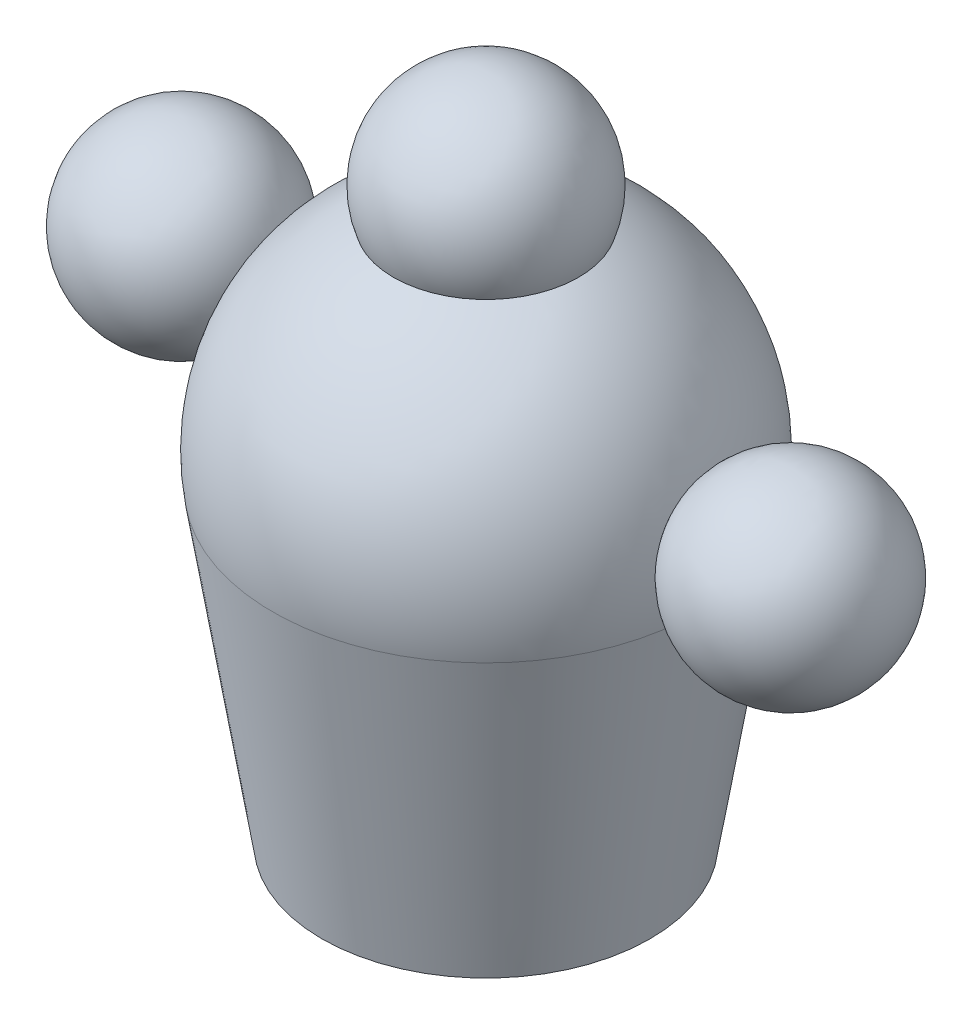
ISO-10303-21;
HEADER;
FILE_DESCRIPTION(('STEP AP214'),'2;1');
FILE_NAME('part.step','',(''),(''),'','','');
FILE_SCHEMA(('AUTOMOTIVE_DESIGN { 1 0 10303 214 1 1 1 1 }'));
ENDSEC;
DATA;
#1=APPLICATION_CONTEXT('core data for automotive mechanical design processes');
#2=APPLICATION_PROTOCOL_DEFINITION('international standard','automotive_design',2000,#1);
#3=PRODUCT_CONTEXT('',#1,'mechanical');
#4=PRODUCT('Part','Part','',(#3));
#5=PRODUCT_RELATED_PRODUCT_CATEGORY('part','',(#4));
#6=PRODUCT_DEFINITION_FORMATION('','',#4);
#7=PRODUCT_DEFINITION_CONTEXT('part definition',#1,'design');
#8=PRODUCT_DEFINITION('design','',#6,#7);
#9=PRODUCT_DEFINITION_SHAPE('','',#8);
#10=(LENGTH_UNIT() NAMED_UNIT(*) SI_UNIT(.MILLI.,.METRE.));
#11=(NAMED_UNIT(*) PLANE_ANGLE_UNIT() SI_UNIT($,.RADIAN.));
#12=(NAMED_UNIT(*) SI_UNIT($,.STERADIAN.) SOLID_ANGLE_UNIT());
#13=UNCERTAINTY_MEASURE_WITH_UNIT(LENGTH_MEASURE(1.E-05),#10,'distance_accuracy_value','');
#14=(GEOMETRIC_REPRESENTATION_CONTEXT(3) GLOBAL_UNCERTAINTY_ASSIGNED_CONTEXT((#13)) GLOBAL_UNIT_ASSIGNED_CONTEXT((#10,
#11,#12)) REPRESENTATION_CONTEXT('',''));
#15=CARTESIAN_POINT('',(0.,0.,0.));
#16=DIRECTION('',(0.,0.,1.));
#17=DIRECTION('',(1.,0.,0.));
#18=AXIS2_PLACEMENT_3D('',#15,#16,#17);
#19=CARTESIAN_POINT('',(0.,179.699675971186,0.));
#20=DIRECTION('',(0.,-1.,0.));
#21=DIRECTION('',(1.,0.,0.));
#22=AXIS2_PLACEMENT_3D('',#19,#20,#21);
#23=SPHERICAL_SURFACE('',#22,113.550324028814);
#24=CARTESIAN_POINT('',(111.80528808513,194.758677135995,0.));
#25=DIRECTION('',(0.991050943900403,0.133484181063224,0.));
#26=DIRECTION('',(-0.133484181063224,0.991050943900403,0.));
#27=AXIS2_PLACEMENT_3D('',#24,#25,#26);
#28=CIRCLE('',#27,12.9027178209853);
#29=CARTESIAN_POINT('',(110.082979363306,207.545927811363,0.));
#30=VERTEX_POINT('',#29);
#31=EDGE_CURVE('E87',#30,#30,#28,.F.);
#32=ORIENTED_EDGE('',*,*,#31,.T.);
#33=EDGE_LOOP('',(#32));
#34=FACE_BOUND('',#33,.T.);
#35=CARTESIAN_POINT('',(0.,179.699675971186,-90.));
#36=DIRECTION('',(0.,0.,1.));
#37=DIRECTION('',(1.,0.,0.));
#38=AXIS2_PLACEMENT_3D('',#35,#36,#37);
#39=CIRCLE('',#38,69.2363783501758);
#40=CARTESIAN_POINT('',(-66.8731308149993,161.764780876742,-90.));
#41=VERTEX_POINT('',#40);
#42=CARTESIAN_POINT('',(66.8731308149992,161.764780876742,-90.));
#43=VERTEX_POINT('',#42);
#44=EDGE_CURVE('E58',#41,#43,#39,.F.);
#45=ORIENTED_EDGE('',*,*,#44,.F.);
#46=CARTESIAN_POINT('',(0.,161.764780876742,0.));
#47=DIRECTION('',(0.,-1.,0.));
#48=DIRECTION('',(0.,0.,-1.));
#49=AXIS2_PLACEMENT_3D('',#46,#47,#48);
#50=CIRCLE('',#49,112.125);
#51=EDGE_CURVE('E44',#43,#41,#50,.T.);
#52=ORIENTED_EDGE('',*,*,#51,.F.);
#53=EDGE_LOOP('',(#45,#52));
#54=FACE_BOUND('',#53,.T.);
#55=CARTESIAN_POINT('',(-111.80528808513,194.758677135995,0.));
#56=DIRECTION('',(-0.991050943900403,0.133484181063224,0.));
#57=DIRECTION('',(-0.133484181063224,-0.991050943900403,0.));
#58=AXIS2_PLACEMENT_3D('',#55,#56,#57);
#59=CIRCLE('',#58,12.9027178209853);
#60=CARTESIAN_POINT('',(-113.527596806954,181.971426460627,0.));
#61=VERTEX_POINT('',#60);
#62=EDGE_CURVE('E62',#61,#61,#59,.F.);
#63=ORIENTED_EDGE('',*,*,#62,.T.);
#64=EDGE_LOOP('',(#63));
#65=FACE_BOUND('',#64,.T.);
#66=CARTESIAN_POINT('',(0.,282.308632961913,0.));
#67=DIRECTION('',(0.,1.,0.));
#68=DIRECTION('',(0.,0.,1.));
#69=AXIS2_PLACEMENT_3D('',#66,#67,#68);
#70=CIRCLE('',#69,48.6320679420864);
#71=CARTESIAN_POINT('',(0.,282.308632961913,48.6320679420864));
#72=VERTEX_POINT('',#71);
#73=EDGE_CURVE('E39',#72,#72,#70,.F.);
#74=ORIENTED_EDGE('',*,*,#73,.T.);
#75=EDGE_LOOP('',(#74));
#76=FACE_BOUND('',#75,.T.);
#77=ADVANCED_FACE('F36',(#34,#54,#65,#76),#23,.T.);
#78=CARTESIAN_POINT('',(0.,0.,0.));
#79=DIRECTION('',(0.,1.,0.));
#80=DIRECTION('',(0.,0.,1.));
#81=AXIS2_PLACEMENT_3D('',#78,#79,#80);
#82=CONICAL_SURFACE('',#81,86.25,0.15861086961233);
#83=CARTESIAN_POINT('',(-147.890131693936,543.109312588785,-90.));
#84=CARTESIAN_POINT('',(-146.745586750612,536.996806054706,-90.));
#85=CARTESIAN_POINT('',(-145.59758522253,530.88494749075,-90.));
#86=CARTESIAN_POINT('',(-143.294137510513,518.66263228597,-90.));
#87=CARTESIAN_POINT('',(-142.138691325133,512.552175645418,-90.));
#88=CARTESIAN_POINT('',(-138.660377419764,494.223008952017,-90.));
#89=CARTESIAN_POINT('',(-136.325545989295,482.006564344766,-90.));
#90=CARTESIAN_POINT('',(-132.795261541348,463.686173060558,-90.));
#91=CARTESIAN_POINT('',(-131.613720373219,457.579543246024,-90.));
#92=CARTESIAN_POINT('',(-129.240576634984,445.36824073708,-90.));
#93=CARTESIAN_POINT('',(-128.048974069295,439.263568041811,-90.));
#94=CARTESIAN_POINT('',(-125.654855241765,427.056378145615,-90.));
#95=CARTESIAN_POINT('',(-124.45233900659,420.953860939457,-90.));
#96=CARTESIAN_POINT('',(-122.035417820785,408.751169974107,-90.));
#97=CARTESIAN_POINT('',(-120.821012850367,402.650996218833,-90.));
#98=CARTESIAN_POINT('',(-118.374860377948,390.431474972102,-90.));
#99=CARTESIAN_POINT('',(-117.14306644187,384.312136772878,-90.));
#100=CARTESIAN_POINT('',(-114.665137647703,372.076364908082,-90.));
#101=CARTESIAN_POINT('',(-113.419002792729,365.959931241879,-90.));
#102=CARTESIAN_POINT('',(-110.910944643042,353.730310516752,-90.));
#103=CARTESIAN_POINT('',(-109.649021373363,347.617123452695,-90.));
#104=CARTESIAN_POINT('',(-107.107713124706,335.394382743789,-90.));
#105=CARTESIAN_POINT('',(-105.828328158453,329.284829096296,-90.));
#106=CARTESIAN_POINT('',(-103.250253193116,317.070295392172,-90.));
#107=CARTESIAN_POINT('',(-101.951564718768,310.965315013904,-90.));
#108=CARTESIAN_POINT('',(-99.332507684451,298.760002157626,-90.));
#109=CARTESIAN_POINT('',(-98.0121391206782,292.659669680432,-90.));
#110=CARTESIAN_POINT('',(-95.3470400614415,280.464376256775,-90.));
#111=CARTESIAN_POINT('',(-94.0023097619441,274.369415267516,-90.));
#112=CARTESIAN_POINT('',(-91.2852673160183,262.185649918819,-90.));
#113=CARTESIAN_POINT('',(-89.9129552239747,256.096845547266,-90.));
#114=CARTESIAN_POINT('',(-87.3361414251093,244.800110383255,-90.));
#115=CARTESIAN_POINT('',(-86.1358352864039,239.591222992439,-90.));
#116=CARTESIAN_POINT('',(-83.7091763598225,229.179511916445,-90.));
#117=CARTESIAN_POINT('',(-82.4828235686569,223.976688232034,-90.));
#118=CARTESIAN_POINT('',(-80.0004438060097,213.577743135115,-90.));
#119=CARTESIAN_POINT('',(-78.7444148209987,208.38162220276,-90.));
#120=CARTESIAN_POINT('',(-76.1984435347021,197.997690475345,-90.));
#121=CARTESIAN_POINT('',(-74.9085012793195,192.809879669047,-90.));
#122=CARTESIAN_POINT('',(-72.290555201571,182.448939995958,-90.));
#123=CARTESIAN_POINT('',(-70.9625875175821,177.275802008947,-90.));
#124=CARTESIAN_POINT('',(-68.2607526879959,166.941445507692,-90.));
#125=CARTESIAN_POINT('',(-66.8868852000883,161.780227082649,-90.));
#126=CARTESIAN_POINT('',(-64.7852294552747,154.049867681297,-90.));
#127=CARTESIAN_POINT('',(-64.077914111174,151.475153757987,-90.));
#128=CARTESIAN_POINT('',(-62.6482792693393,146.329897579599,-90.));
#129=CARTESIAN_POINT('',(-61.9259598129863,143.759355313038,-90.));
#130=CARTESIAN_POINT('',(-60.4648007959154,138.62300860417,-90.));
#131=CARTESIAN_POINT('',(-59.7259614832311,136.057204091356,-90.));
#132=CARTESIAN_POINT('',(-58.2299639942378,130.930947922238,-90.));
#133=CARTESIAN_POINT('',(-57.4728058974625,128.370496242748,-90.));
#134=CARTESIAN_POINT('',(-55.9367339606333,123.25128341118,-90.));
#135=CARTESIAN_POINT('',(-55.1577846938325,120.692532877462,-90.));
#136=CARTESIAN_POINT('',(-53.5768739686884,115.582141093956,-90.));
#137=CARTESIAN_POINT('',(-52.7749125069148,113.030499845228,-90.));
#138=CARTESIAN_POINT('',(-51.1447881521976,107.935020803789,-90.));
#139=CARTESIAN_POINT('',(-50.3166200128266,105.391184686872,-90.));
#140=CARTESIAN_POINT('',(-48.6305495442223,100.313380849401,-90.));
#141=CARTESIAN_POINT('',(-47.7726473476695,97.7794130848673,-90.));
#142=CARTESIAN_POINT('',(-46.0209407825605,92.7187030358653,-90.));
#143=CARTESIAN_POINT('',(-45.1270736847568,90.1919824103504,-90.));
#144=CARTESIAN_POINT('',(-43.2990962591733,85.1530390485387,-90.));
#145=CARTESIAN_POINT('',(-42.364984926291,82.6408166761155,-90.));
#146=CARTESIAN_POINT('',(-40.4494944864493,77.6355238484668,-90.));
#147=CARTESIAN_POINT('',(-39.4681347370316,75.1424460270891,-90.));
#148=CARTESIAN_POINT('',(-37.9529905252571,71.4204639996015,-90.));
#149=CARTESIAN_POINT('',(-37.4407691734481,70.1827673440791,-90.));
#150=CARTESIAN_POINT('',(-36.4003619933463,67.7141096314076,-90.));
#151=CARTESIAN_POINT('',(-35.8721763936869,66.4831484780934,-90.));
#152=CARTESIAN_POINT('',(-34.7947720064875,64.0215568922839,-90.));
#153=CARTESIAN_POINT('',(-34.245445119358,62.7909737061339,-90.));
#154=CARTESIAN_POINT('',(-33.1266062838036,60.3390375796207,-90.));
#155=CARTESIAN_POINT('',(-32.557094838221,59.1176844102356,-90.));
#156=CARTESIAN_POINT('',(-31.3948622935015,56.6851022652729,-90.));
#157=CARTESIAN_POINT('',(-30.8021267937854,55.4738801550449,-90.));
#158=CARTESIAN_POINT('',(-29.5905702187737,53.0645475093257,-90.));
#159=CARTESIAN_POINT('',(-28.9717496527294,51.8664367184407,-90.));
#160=CARTESIAN_POINT('',(-27.7059408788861,49.4897504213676,-90.));
#161=CARTESIAN_POINT('',(-27.059042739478,48.3111270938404,-90.));
#162=CARTESIAN_POINT('',(-25.730370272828,45.9734607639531,-90.));
#163=CARTESIAN_POINT('',(-25.0485924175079,44.8144197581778,-90.));
#164=CARTESIAN_POINT('',(-23.6447517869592,42.5226117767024,-90.));
#165=CARTESIAN_POINT('',(-22.9227333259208,41.3898177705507,-90.));
#166=CARTESIAN_POINT('',(-21.4299549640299,39.1569812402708,-90.));
#167=CARTESIAN_POINT('',(-20.6592092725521,38.056929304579,-90.));
#168=CARTESIAN_POINT('',(-19.2982722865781,36.2237065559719,-90.));
#169=CARTESIAN_POINT('',(-18.7231661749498,35.4793559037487,-90.));
#170=CARTESIAN_POINT('',(-17.5392282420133,34.0175606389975,-90.));
#171=CARTESIAN_POINT('',(-16.9303900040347,33.3001211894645,-90.));
#172=CARTESIAN_POINT('',(-15.6741030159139,31.9002613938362,-90.));
#173=CARTESIAN_POINT('',(-15.0266723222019,31.2178249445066,-90.));
#174=CARTESIAN_POINT('',(-13.6870256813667,29.8984734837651,-90.));
#175=CARTESIAN_POINT('',(-12.9948298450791,29.2615382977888,-90.));
#176=CARTESIAN_POINT('',(-11.808869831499,28.2594963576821,-90.));
#177=CARTESIAN_POINT('',(-11.3299177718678,27.8769521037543,-90.));
#178=CARTESIAN_POINT('',(-10.3486337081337,27.1433510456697,-90.));
#179=CARTESIAN_POINT('',(-9.84629834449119,26.7922987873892,-90.));
#180=CARTESIAN_POINT('',(-8.30324455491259,25.7976173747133,-90.));
#181=CARTESIAN_POINT('',(-7.22367285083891,25.2099962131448,-90.));
#182=CARTESIAN_POINT('',(-5.69690427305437,24.5647020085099,-90.));
#183=CARTESIAN_POINT('',(-5.28997172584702,24.4093831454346,-90.));
#184=CARTESIAN_POINT('',(-4.46545244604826,24.1304450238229,-90.));
#185=CARTESIAN_POINT('',(-4.04787131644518,24.0068094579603,-90.));
#186=CARTESIAN_POINT('',(-3.20430183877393,23.7945129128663,-90.));
#187=CARTESIAN_POINT('',(-2.7783220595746,23.705818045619,-90.));
#188=CARTESIAN_POINT('',(-1.92020634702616,23.5658348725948,-90.));
#189=CARTESIAN_POINT('',(-1.48807042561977,23.5145464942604,-90.));
#190=CARTESIAN_POINT('',(-0.618819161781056,23.4508807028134,-90.));
#191=CARTESIAN_POINT('',(-0.18168985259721,23.4386922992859,-90.));
#192=CARTESIAN_POINT('',(0.691846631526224,23.4541696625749,-90.));
#193=CARTESIAN_POINT('',(1.1282538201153,23.4818346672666,-90.));
#194=CARTESIAN_POINT('',(1.99705857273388,23.5761190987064,-90.));
#195=CARTESIAN_POINT('',(2.42945373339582,23.6427605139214,-90.));
#196=CARTESIAN_POINT('',(3.28708000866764,23.8129397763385,-90.));
#197=CARTESIAN_POINT('',(3.71230722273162,23.9164970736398,-90.));
#198=CARTESIAN_POINT('',(4.64757583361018,24.1847097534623,-90.));
#199=CARTESIAN_POINT('',(5.15517977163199,24.35786873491,-90.));
#200=CARTESIAN_POINT('',(6.15304053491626,24.7489853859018,-90.));
#201=CARTESIAN_POINT('',(6.64328414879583,24.9669763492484,-90.));
#202=CARTESIAN_POINT('',(7.60550310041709,25.441653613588,-90.));
#203=CARTESIAN_POINT('',(8.07744803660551,25.6984011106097,-90.));
#204=CARTESIAN_POINT('',(9.00188707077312,26.2443318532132,-90.));
#205=CARTESIAN_POINT('',(9.45438491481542,26.5335088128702,-90.));
#206=CARTESIAN_POINT('',(10.6752417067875,27.3678061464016,-90.));
#207=CARTESIAN_POINT('',(11.424208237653,27.941358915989,-90.));
#208=CARTESIAN_POINT('',(12.870259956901,29.1505365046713,-90.));
#209=CARTESIAN_POINT('',(13.5673002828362,29.7862139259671,-90.));
#210=CARTESIAN_POINT('',(14.9174872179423,31.105521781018,-90.));
#211=CARTESIAN_POINT('',(15.5705216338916,31.7892663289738,-90.));
#212=CARTESIAN_POINT('',(16.520164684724,32.8412838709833,-90.));
#213=CARTESIAN_POINT('',(16.8316816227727,33.1962994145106,-90.));
#214=CARTESIAN_POINT('',(17.4455356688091,33.9142004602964,-90.));
#215=CARTESIAN_POINT('',(17.7478726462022,34.2770860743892,-90.));
#216=CARTESIAN_POINT('',(18.5416815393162,35.2527339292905,-90.));
#217=CARTESIAN_POINT('',(19.0256274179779,35.8716243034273,-90.));
#218=CARTESIAN_POINT('',(19.9726246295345,37.1252448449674,-90.));
#219=CARTESIAN_POINT('',(20.4356731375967,37.7599771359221,-90.));
#220=CARTESIAN_POINT('',(21.3433159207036,39.0429194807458,-90.));
#221=CARTESIAN_POINT('',(21.7879014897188,39.6911356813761,-90.));
#222=CARTESIAN_POINT('',(22.6603504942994,40.9987454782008,-90.));
#223=CARTESIAN_POINT('',(23.0882128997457,41.6581397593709,-90.));
#224=CARTESIAN_POINT('',(24.3510445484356,43.6533240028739,-90.));
#225=CARTESIAN_POINT('',(25.1634008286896,45.0034548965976,-90.));
#226=CARTESIAN_POINT('',(26.7384640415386,47.7316969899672,-90.));
#227=CARTESIAN_POINT('',(27.5011823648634,49.1098016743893,-90.));
#228=CARTESIAN_POINT('',(28.9899202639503,51.896562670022,-90.));
#229=CARTESIAN_POINT('',(29.7156843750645,53.3053550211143,-90.));
#230=CARTESIAN_POINT('',(31.1318453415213,56.140621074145,-90.));
#231=CARTESIAN_POINT('',(31.8222404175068,57.5670956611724,-90.));
#232=CARTESIAN_POINT('',(33.1716984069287,60.4323161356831,-90.));
#233=CARTESIAN_POINT('',(33.8308038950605,61.871042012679,-90.));
#234=CARTESIAN_POINT('',(34.7996902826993,64.0379001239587,-90.));
#235=CARTESIAN_POINT('',(35.1193527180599,64.7616374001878,-90.));
#236=CARTESIAN_POINT('',(35.7525073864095,66.2118079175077,-90.));
#237=CARTESIAN_POINT('',(36.0659996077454,66.938241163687,-90.));
#238=CARTESIAN_POINT('',(37.1117053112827,69.3880412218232,-90.));
#239=CARTESIAN_POINT('',(37.8306454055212,71.1170861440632,-90.));
#240=CARTESIAN_POINT('',(39.2405582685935,74.5865680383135,-90.));
#241=CARTESIAN_POINT('',(39.9315300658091,76.3270054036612,-90.));
#242=CARTESIAN_POINT('',(41.2890524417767,79.8176232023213,-90.));
#243=CARTESIAN_POINT('',(41.9555998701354,81.5678048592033,-90.));
#244=CARTESIAN_POINT('',(43.2670303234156,85.076230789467,-90.));
#245=CARTESIAN_POINT('',(43.9119135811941,86.8344749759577,-90.));
#246=CARTESIAN_POINT('',(45.1827210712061,90.3588135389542,-90.));
#247=CARTESIAN_POINT('',(45.8086353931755,92.124911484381,-90.));
#248=CARTESIAN_POINT('',(47.0431539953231,95.6631445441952,-90.));
#249=CARTESIAN_POINT('',(47.6517582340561,97.4352796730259,-90.));
#250=CARTESIAN_POINT('',(48.8533102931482,100.984716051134,-90.));
#251=CARTESIAN_POINT('',(49.4462591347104,102.762016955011,-90.));
#252=CARTESIAN_POINT('',(50.6179836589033,106.321288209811,-90.));
#253=CARTESIAN_POINT('',(51.1967592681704,108.103258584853,-90.));
#254=CARTESIAN_POINT('',(52.9161954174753,113.463003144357,-90.));
#255=CARTESIAN_POINT('',(54.0374100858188,117.04702492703,-90.));
#256=CARTESIAN_POINT('',(56.2362933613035,124.22839952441,-90.));
#257=CARTESIAN_POINT('',(57.3139614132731,127.825752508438,-90.));
#258=CARTESIAN_POINT('',(59.4317520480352,135.030361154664,-90.));
#259=CARTESIAN_POINT('',(60.4718852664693,138.63761369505,-90.));
#260=CARTESIAN_POINT('',(62.5199475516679,145.861215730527,-90.));
#261=CARTESIAN_POINT('',(63.5278767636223,149.477565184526,-90.));
#262=CARTESIAN_POINT('',(65.5144157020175,156.713720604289,-90.));
#263=CARTESIAN_POINT('',(66.4930585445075,160.333517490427,-90.));
#264=CARTESIAN_POINT('',(68.4255716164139,167.579713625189,-90.));
#265=CARTESIAN_POINT('',(69.3794418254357,171.206112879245,-90.));
#266=CARTESIAN_POINT('',(71.2652206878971,178.464864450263,-90.));
#267=CARTESIAN_POINT('',(72.1971279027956,182.097217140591,-90.));
#268=CARTESIAN_POINT('',(74.0412286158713,189.366917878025,-90.));
#269=CARTESIAN_POINT('',(74.9534221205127,193.004265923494,-90.));
#270=CARTESIAN_POINT('',(76.7589438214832,200.278868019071,-90.));
#271=CARTESIAN_POINT('',(77.6522939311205,203.916116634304,-90.));
#272=CARTESIAN_POINT('',(79.4229652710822,211.194510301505,-90.));
#273=CARTESIAN_POINT('',(80.3002865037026,214.835655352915,-90.));
#274=CARTESIAN_POINT('',(82.0403286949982,222.121336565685,-90.));
#275=CARTESIAN_POINT('',(82.9030500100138,225.765872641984,-90.));
#276=CARTESIAN_POINT('',(84.6151731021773,233.058071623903,-90.));
#277=CARTESIAN_POINT('',(85.4645748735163,236.705734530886,-90.));
#278=CARTESIAN_POINT('',(87.5561457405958,245.756256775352,-90.));
#279=CARTESIAN_POINT('',(88.7910460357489,251.160796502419,-90.));
#280=CARTESIAN_POINT('',(91.2371823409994,261.975234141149,-90.));
#281=CARTESIAN_POINT('',(92.4484183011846,267.385132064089,-90.));
#282=CARTESIAN_POINT('',(94.8497976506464,278.209649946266,-90.));
#283=CARTESIAN_POINT('',(96.039940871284,283.624269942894,-90.));
#284=CARTESIAN_POINT('',(98.4013018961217,294.457628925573,-90.));
#285=CARTESIAN_POINT('',(99.5725197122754,299.87636790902,-90.));
#286=CARTESIAN_POINT('',(101.897940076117,310.717728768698,-90.));
#287=CARTESIAN_POINT('',(103.052141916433,316.14035079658,-90.));
#288=CARTESIAN_POINT('',(105.345085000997,326.988861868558,-90.));
#289=CARTESIAN_POINT('',(106.483826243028,332.414750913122,-90.));
#290=CARTESIAN_POINT('',(108.74723803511,343.269439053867,-90.));
#291=CARTESIAN_POINT('',(109.871908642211,348.698238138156,-90.));
#292=CARTESIAN_POINT('',(112.108394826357,359.558484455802,-90.));
#293=CARTESIAN_POINT('',(113.220210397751,364.989931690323,-90.));
#294=CARTESIAN_POINT('',(116.539589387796,381.295600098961,-90.));
#295=CARTESIAN_POINT('',(118.729477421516,392.173422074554,-90.));
#296=CARTESIAN_POINT('',(123.069320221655,413.93702420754,-90.));
#297=CARTESIAN_POINT('',(125.21927495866,424.822804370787,-90.));
#298=CARTESIAN_POINT('',(129.48485189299,446.600841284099,-90.));
#299=CARTESIAN_POINT('',(131.600474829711,457.493097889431,-90.));
#300=CARTESIAN_POINT('',(135.802017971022,479.283330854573,-90.));
#301=CARTESIAN_POINT('',(137.887938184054,490.181307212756,-90.));
#302=CARTESIAN_POINT('',(142.006678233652,511.839432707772,-90.));
#303=CARTESIAN_POINT('',(144.039835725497,522.599517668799,-90.));
#304=CARTESIAN_POINT('',(148.083868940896,544.123872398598,-90.));
#305=CARTESIAN_POINT('',(150.094744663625,554.888142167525,-90.));
#306=CARTESIAN_POINT('',(154.096744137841,576.420428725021,-90.));
#307=CARTESIAN_POINT('',(156.087867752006,587.188445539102,-90.));
#308=CARTESIAN_POINT('',(160.052481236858,608.727725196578,-90.));
#309=CARTESIAN_POINT('',(162.025971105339,619.498988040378,-90.));
#310=CARTESIAN_POINT('',(165.955212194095,641.033835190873,-90.));
#311=CARTESIAN_POINT('',(167.910978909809,651.797416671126,-90.));
#312=CARTESIAN_POINT('',(171.808293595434,673.327153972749,-90.));
#313=CARTESIAN_POINT('',(173.749841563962,684.09330979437,-90.));
#314=CARTESIAN_POINT('',(177.620058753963,705.627803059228,-90.));
#315=CARTESIAN_POINT('',(179.548728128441,716.396140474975,-90.));
#316=CARTESIAN_POINT('',(183.394360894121,737.934901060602,-90.));
#317=CARTESIAN_POINT('',(185.311324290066,748.705324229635,-90.));
#318=CARTESIAN_POINT('',(187.223010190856,759.476682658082,-90.));
#319=B_SPLINE_CURVE_WITH_KNOTS('',3,(#83,#84,#85,#86,#87,#88,#89,#90,#91,#92,#93,#94,#95,#96,
#97,#98,#99,#100,#101,#102,#103,#104,#105,#106,#107,#108,#109,#110,#111,#112,#113,#114,#115,
#116,#117,#118,#119,#120,#121,#122,#123,#124,#125,#126,#127,#128,#129,#130,#131,#132,#133,#134,
#135,#136,#137,#138,#139,#140,#141,#142,#143,#144,#145,#146,#147,#148,#149,#150,#151,#152,#153,
#154,#155,#156,#157,#158,#159,#160,#161,#162,#163,#164,#165,#166,#167,#168,#169,#170,#171,#172,
#173,#174,#175,#176,#177,#178,#179,#180,#181,#182,#183,#184,#185,#186,#187,#188,#189,#190,#191,
#192,#193,#194,#195,#196,#197,#198,#199,#200,#201,#202,#203,#204,#205,#206,#207,#208,#209,#210,
#211,#212,#213,#214,#215,#216,#217,#218,#219,#220,#221,#222,#223,#224,#225,#226,#227,#228,#229,
#230,#231,#232,#233,#234,#235,#236,#237,#238,#239,#240,#241,#242,#243,#244,#245,#246,#247,#248,
#249,#250,#251,#252,#253,#254,#255,#256,#257,#258,#259,#260,#261,#262,#263,#264,#265,#266,#267,
#268,#269,#270,#271,#272,#273,#274,#275,#276,#277,#278,#279,#280,#281,#282,#283,#284,#285,#286,
#287,#288,#289,#290,#291,#292,#293,#294,#295,#296,#297,#298,#299,#300,#301,#302,#303,#304,#305,
#306,#307,#308,#309,#310,#311,#312,#313,#314,#315,#316,#317,#318),.UNSPECIFIED.,.F.,.F.,(4,2,2,
2,2,2,2,2,2,2,2,2,2,2,2,2,2,2,2,2,2,2,2,2,2,2,2,2,2,2,2,2,2,2,2,2,2,2,2,2,2,2,2,2,2,2,2,2,2,2,2,
2,2,2,2,2,2,2,2,2,2,2,2,2,2,2,2,2,2,2,2,2,2,2,2,2,2,2,2,2,2,2,2,2,2,2,2,2,2,2,2,2,2,2,2,2,2,2,2,
2,2,2,2,2,2,2,2,2,2,2,2,2,2,2,2,2,2,4),(0.,18.6562152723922,37.3124341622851,74.6250618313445,
93.2847097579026,111.944349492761,130.60394364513,149.263568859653,167.989806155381,
186.716039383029,205.442242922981,224.168432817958,242.893151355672,261.617873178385,
280.342444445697,299.066978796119,315.103104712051,331.139232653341,347.176451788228,
363.213649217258,379.236080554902,395.258631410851,403.268901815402,411.27915013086,
419.289278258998,427.299371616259,435.323345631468,443.347320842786,451.372912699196,
459.398468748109,467.438687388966,475.479106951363,483.516259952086,487.534673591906,
491.553029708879,495.595746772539,499.638363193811,503.683527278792,507.728612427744,
511.761562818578,515.794921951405,519.823923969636,523.851756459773,526.672892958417,
529.494567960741,532.314932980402,535.134039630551,536.971712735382,538.809650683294,
542.474395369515,543.780125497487,545.085182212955,546.388970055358,547.692755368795,
549.002833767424,550.312887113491,551.623680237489,552.935165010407,554.541654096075,
556.149340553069,557.759592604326,559.369533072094,562.194682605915,565.022245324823,
567.856763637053,569.273583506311,570.690423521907,573.046792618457,575.403479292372,
577.761264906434,580.119195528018,584.844780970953,589.569278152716,594.322925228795,
599.07681121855,603.82403160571,606.197574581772,608.571122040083,614.188474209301,
619.806021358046,625.424290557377,631.042499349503,636.663594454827,642.284703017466,
647.905444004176,653.526214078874,664.791765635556,676.057460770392,687.319938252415,
698.582364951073,709.83153438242,721.080713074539,732.330626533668,743.580536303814,
754.816548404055,766.052558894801,777.288294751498,788.52403550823,805.155454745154,
821.78690905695,838.418496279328,855.050072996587,871.68233916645,888.314607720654,
904.94680881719,921.579017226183,954.867108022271,988.155223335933,1021.44262077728,
1054.73000875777,1087.58144226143,1120.43287698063,1153.28453993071,1186.1362069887,
1218.95566306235,1251.7751223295,1284.5941909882,1317.41324634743),.UNSPECIFIED.);
#320=EDGE_CURVE('E12',#43,#41,#319,.F.);
#321=ORIENTED_EDGE('',*,*,#320,.F.);
#322=ORIENTED_EDGE('',*,*,#51,.T.);
#323=EDGE_LOOP('',(#321,#322));
#324=FACE_BOUND('',#323,.T.);
#325=CARTESIAN_POINT('',(0.,0.,0.));
#326=DIRECTION('',(0.,-1.,0.));
#327=DIRECTION('',(0.,0.,-1.));
#328=AXIS2_PLACEMENT_3D('',#325,#326,#327);
#329=CIRCLE('',#328,86.25);
#330=CARTESIAN_POINT('',(0.,0.,-86.25));
#331=VERTEX_POINT('',#330);
#332=EDGE_CURVE('E56',#331,#331,#329,.T.);
#333=ORIENTED_EDGE('',*,*,#332,.F.);
#334=EDGE_LOOP('',(#333));
#335=FACE_BOUND('',#334,.T.);
#336=ADVANCED_FACE('F52',(#324,#335),#82,.T.);
#337=CARTESIAN_POINT('',(86.25,0.,0.));
#338=DIRECTION('',(0.,-1.,0.));
#339=DIRECTION('',(0.,0.,-1.));
#340=AXIS2_PLACEMENT_3D('',#337,#338,#339);
#341=PLANE('',#340);
#342=CARTESIAN_POINT('',(0.,0.,0.));
#343=DIRECTION('',(0.,1.,0.));
#344=DIRECTION('',(0.,0.,1.));
#345=AXIS2_PLACEMENT_3D('',#342,#343,#344);
#346=CIRCLE('',#345,71.875);
#347=CARTESIAN_POINT('',(0.,0.,71.875));
#348=VERTEX_POINT('',#347);
#349=EDGE_CURVE('E61',#348,#348,#346,.T.);
#350=ORIENTED_EDGE('',*,*,#349,.T.);
#351=EDGE_LOOP('',(#350));
#352=FACE_BOUND('',#351,.T.);
#353=ORIENTED_EDGE('',*,*,#332,.T.);
#354=EDGE_LOOP('',(#353));
#355=FACE_BOUND('',#354,.T.);
#356=ADVANCED_FACE('F76',(#352,#355),#341,.T.);
#357=CARTESIAN_POINT('',(0.,-47.6764813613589,0.));
#358=DIRECTION('',(0.,1.,0.));
#359=DIRECTION('',(1.,0.,0.));
#360=AXIS2_PLACEMENT_3D('',#357,#358,#359);
#361=SPHERICAL_SURFACE('',#360,86.25);
#362=ORIENTED_EDGE('',*,*,#349,.F.);
#363=EDGE_LOOP('',(#362));
#364=FACE_BOUND('',#363,.T.);
#365=ADVANCED_FACE('F67',(#364),#361,.F.);
#366=CARTESIAN_POINT('',(0.,0.,-90.));
#367=DIRECTION('',(0.,0.,1.));
#368=DIRECTION('',(1.,0.,0.));
#369=AXIS2_PLACEMENT_3D('',#366,#367,#368);
#370=PLANE('',#369);
#371=ORIENTED_EDGE('',*,*,#320,.T.);
#372=ORIENTED_EDGE('',*,*,#44,.T.);
#373=EDGE_LOOP('',(#371,#372));
#374=FACE_BOUND('',#373,.T.);
#375=ADVANCED_FACE('F64',(#374),#370,.F.);
#376=CARTESIAN_POINT('',(-160.,201.25,0.));
#377=DIRECTION('',(1.,0.,0.));
#378=DIRECTION('',(0.,0.,1.));
#379=AXIS2_PLACEMENT_3D('',#376,#377,#378);
#380=SPHERICAL_SURFACE('',#379,50.3125);
#381=CARTESIAN_POINT('',(-160.,201.25,0.));
#382=DIRECTION('',(-0.991050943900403,0.133484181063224,0.));
#383=DIRECTION('',(-0.133484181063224,-0.991050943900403,0.));
#384=AXIS2_PLACEMENT_3D('',#381,#382,#383);
#385=SPHERICAL_SURFACE('',#384,50.3125);
#386=ORIENTED_EDGE('',*,*,#62,.F.);
#387=EDGE_LOOP('',(#386));
#388=FACE_BOUND('',#387,.T.);
#389=ADVANCED_FACE('F66',(#388),#385,.T.);
#390=CARTESIAN_POINT('',(160.,201.25,0.));
#391=DIRECTION('',(-1.,0.,0.));
#392=DIRECTION('',(0.,0.,1.));
#393=AXIS2_PLACEMENT_3D('',#390,#391,#392);
#394=SPHERICAL_SURFACE('',#393,50.3125);
#395=CARTESIAN_POINT('',(160.,201.25,0.));
#396=DIRECTION('',(0.991050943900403,0.133484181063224,0.));
#397=DIRECTION('',(-0.133484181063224,0.991050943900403,0.));
#398=AXIS2_PLACEMENT_3D('',#395,#396,#397);
#399=SPHERICAL_SURFACE('',#398,50.3125);
#400=ORIENTED_EDGE('',*,*,#31,.F.);
#401=EDGE_LOOP('',(#400));
#402=FACE_BOUND('',#401,.T.);
#403=ADVANCED_FACE('F73',(#402),#399,.T.);
#404=CARTESIAN_POINT('',(0.,300.,0.));
#405=DIRECTION('',(0.,-1.,0.));
#406=DIRECTION('',(-1.,0.,0.));
#407=AXIS2_PLACEMENT_3D('',#404,#405,#406);
#408=SPHERICAL_SURFACE('',#407,51.75);
#409=ORIENTED_EDGE('',*,*,#73,.F.);
#410=EDGE_LOOP('',(#409));
#411=FACE_BOUND('',#410,.T.);
#412=ADVANCED_FACE('F136',(#411),#408,.T.);
#413=CLOSED_SHELL('',(#77,#336,#356,#365,#375,#389,#403,#412));
#414=MANIFOLD_SOLID_BREP('B2',#413);
#415=ADVANCED_BREP_SHAPE_REPRESENTATION('',(#18,#414),#14);
#416=SHAPE_DEFINITION_REPRESENTATION(#9,#415);
ENDSEC;
END-ISO-10303-21;
